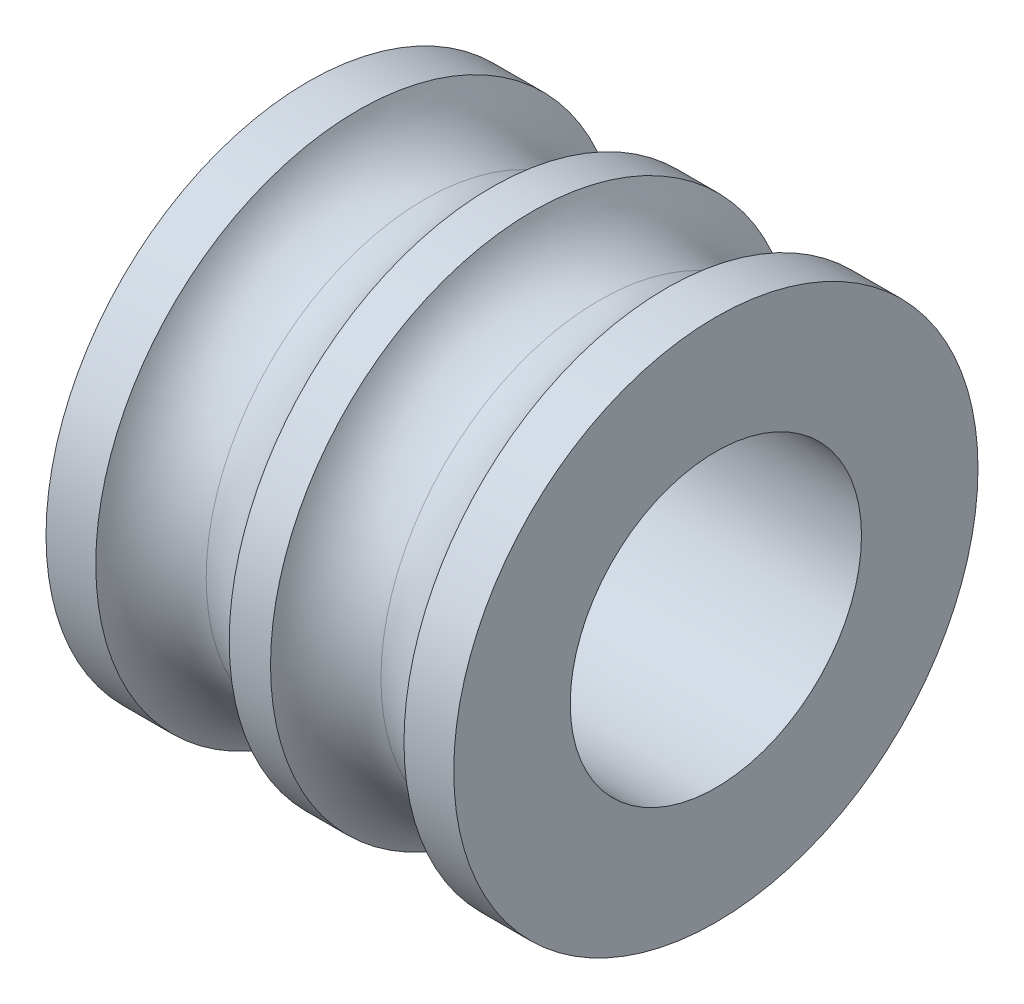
ISO-10303-21;
HEADER;
FILE_DESCRIPTION(('STEP AP214'),'2;1');
FILE_NAME('part.step','',(''),(''),'','','');
FILE_SCHEMA(('AUTOMOTIVE_DESIGN { 1 0 10303 214 1 1 1 1 }'));
ENDSEC;
DATA;
#1=APPLICATION_CONTEXT('core data for automotive mechanical design processes');
#2=APPLICATION_PROTOCOL_DEFINITION('international standard','automotive_design',2000,#1);
#3=PRODUCT_CONTEXT('',#1,'mechanical');
#4=PRODUCT('Part','Part','',(#3));
#5=PRODUCT_RELATED_PRODUCT_CATEGORY('part','',(#4));
#6=PRODUCT_DEFINITION_FORMATION('','',#4);
#7=PRODUCT_DEFINITION_CONTEXT('part definition',#1,'design');
#8=PRODUCT_DEFINITION('design','',#6,#7);
#9=PRODUCT_DEFINITION_SHAPE('','',#8);
#10=(LENGTH_UNIT() NAMED_UNIT(*) SI_UNIT(.MILLI.,.METRE.));
#11=(NAMED_UNIT(*) PLANE_ANGLE_UNIT() SI_UNIT($,.RADIAN.));
#12=(NAMED_UNIT(*) SI_UNIT($,.STERADIAN.) SOLID_ANGLE_UNIT());
#13=UNCERTAINTY_MEASURE_WITH_UNIT(LENGTH_MEASURE(1.E-05),#10,'distance_accuracy_value','');
#14=(GEOMETRIC_REPRESENTATION_CONTEXT(3) GLOBAL_UNCERTAINTY_ASSIGNED_CONTEXT((#13)) GLOBAL_UNIT_ASSIGNED_CONTEXT((#10,
#11,#12)) REPRESENTATION_CONTEXT('',''));
#15=CARTESIAN_POINT('',(0.,0.,0.));
#16=DIRECTION('',(0.,0.,1.));
#17=DIRECTION('',(1.,0.,0.));
#18=AXIS2_PLACEMENT_3D('',#15,#16,#17);
#19=CARTESIAN_POINT('',(7.70871215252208,0.,0.));
#20=DIRECTION('',(-1.,0.,0.));
#21=DIRECTION('',(0.,0.,1.));
#22=AXIS2_PLACEMENT_3D('',#19,#20,#21);
#23=CYLINDRICAL_SURFACE('',#22,9.00000000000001);
#24=CARTESIAN_POINT('',(6.29128784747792,0.,0.));
#25=DIRECTION('',(-1.,0.,0.));
#26=DIRECTION('',(0.,0.,1.));
#27=AXIS2_PLACEMENT_3D('',#24,#25,#26);
#28=CIRCLE('',#27,9.00000000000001);
#29=CARTESIAN_POINT('',(6.29128784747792,0.,9.00000000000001));
#30=VERTEX_POINT('',#29);
#31=EDGE_CURVE('E59',#30,#30,#28,.F.);
#32=ORIENTED_EDGE('',*,*,#31,.T.);
#33=EDGE_LOOP('',(#32));
#34=FACE_BOUND('',#33,.T.);
#35=CARTESIAN_POINT('',(7.70871215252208,0.,0.));
#36=DIRECTION('',(-1.,0.,0.));
#37=DIRECTION('',(0.,0.,1.));
#38=AXIS2_PLACEMENT_3D('',#35,#36,#37);
#39=CIRCLE('',#38,9.00000000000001);
#40=CARTESIAN_POINT('',(7.70871215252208,0.,9.00000000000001));
#41=VERTEX_POINT('',#40);
#42=EDGE_CURVE('E64',#41,#41,#39,.T.);
#43=ORIENTED_EDGE('',*,*,#42,.T.);
#44=EDGE_LOOP('',(#43));
#45=FACE_BOUND('',#44,.T.);
#46=ADVANCED_FACE('F14',(#34,#45),#23,.T.);
#47=CARTESIAN_POINT('',(10.,10.112712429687,7.3473156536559));
#48=CARTESIAN_POINT('',(12.5,10.112712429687,7.3473156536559));
#49=CARTESIAN_POINT('',(12.5,8.0901699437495,5.8778525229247));
#50=CARTESIAN_POINT('',(12.5,6.0676274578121,4.4083893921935));
#51=CARTESIAN_POINT('',(10.,6.0676274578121,4.4083893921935));
#52=(BOUNDED_CURVE() B_SPLINE_CURVE(2,(#47,#48,#49,#50,#51),.UNSPECIFIED.,.F.,
.F.) B_SPLINE_CURVE_WITH_KNOTS((3,2,3),(0.,0.25,0.5),
.UNSPECIFIED.) CURVE() GEOMETRIC_REPRESENTATION_ITEM() RATIONAL_B_SPLINE_CURVE((1.,
0.70710678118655,1.,0.70710678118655,1.)) REPRESENTATION_ITEM(''));
#53=CARTESIAN_POINT('',(12.5,0.,0.));
#54=DIRECTION('',(-1.,0.,0.));
#55=AXIS1_PLACEMENT('',#53,#54);
#56=SURFACE_OF_REVOLUTION('',#52,#55);
#57=CARTESIAN_POINT('',(12.2912878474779,0.,0.));
#58=DIRECTION('',(-1.,0.,0.));
#59=DIRECTION('',(0.,0.,1.));
#60=AXIS2_PLACEMENT_3D('',#57,#58,#59);
#61=CIRCLE('',#60,9.00000000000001);
#62=CARTESIAN_POINT('',(12.2912878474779,0.,9.00000000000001));
#63=VERTEX_POINT('',#62);
#64=EDGE_CURVE('E51',#63,#63,#61,.T.);
#65=ORIENTED_EDGE('',*,*,#64,.T.);
#66=EDGE_LOOP('',(#65));
#67=FACE_BOUND('',#66,.T.);
#68=CARTESIAN_POINT('',(10.,0.,0.));
#69=DIRECTION('',(-1.,0.,0.));
#70=DIRECTION('',(0.,0.80901699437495,0.587785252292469));
#71=AXIS2_PLACEMENT_3D('',#68,#69,#70);
#72=CIRCLE('',#71,7.49999999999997);
#73=CARTESIAN_POINT('',(10.,6.0676274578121,4.4083893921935));
#74=VERTEX_POINT('',#73);
#75=EDGE_CURVE('E62',#74,#74,#72,.T.);
#76=ORIENTED_EDGE('',*,*,#75,.F.);
#77=EDGE_LOOP('',(#76));
#78=FACE_BOUND('',#77,.T.);
#79=ADVANCED_FACE('F87',(#67,#78),#56,.T.);
#80=CARTESIAN_POINT('',(10.,6.0676274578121,4.4083893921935));
#81=CARTESIAN_POINT('',(7.5,6.0676274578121,4.4083893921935));
#82=CARTESIAN_POINT('',(7.5,8.0901699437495,5.8778525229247));
#83=CARTESIAN_POINT('',(7.5,10.112712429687,7.3473156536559));
#84=CARTESIAN_POINT('',(10.,10.112712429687,7.3473156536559));
#85=(BOUNDED_CURVE() B_SPLINE_CURVE(2,(#80,#81,#82,#83,#84),.UNSPECIFIED.,.F.,
.F.) B_SPLINE_CURVE_WITH_KNOTS((3,2,3),(0.5,0.75,1.),
.UNSPECIFIED.) CURVE() GEOMETRIC_REPRESENTATION_ITEM() RATIONAL_B_SPLINE_CURVE((1.,
0.70710678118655,1.,0.70710678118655,1.)) REPRESENTATION_ITEM(''));
#86=CARTESIAN_POINT('',(12.5,0.,0.));
#87=DIRECTION('',(-1.,0.,0.));
#88=AXIS1_PLACEMENT('',#86,#87);
#89=SURFACE_OF_REVOLUTION('',#85,#88);
#90=ORIENTED_EDGE('',*,*,#75,.T.);
#91=EDGE_LOOP('',(#90));
#92=FACE_BOUND('',#91,.T.);
#93=ORIENTED_EDGE('',*,*,#42,.F.);
#94=EDGE_LOOP('',(#93));
#95=FACE_BOUND('',#94,.T.);
#96=ADVANCED_FACE('F91',(#92,#95),#89,.T.);
#97=CARTESIAN_POINT('',(4.,10.112712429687,7.3473156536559));
#98=CARTESIAN_POINT('',(6.5,10.112712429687,7.3473156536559));
#99=CARTESIAN_POINT('',(6.5,8.0901699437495,5.8778525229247));
#100=CARTESIAN_POINT('',(6.5,6.0676274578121,4.4083893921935));
#101=CARTESIAN_POINT('',(4.,6.0676274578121,4.4083893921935));
#102=(BOUNDED_CURVE() B_SPLINE_CURVE(2,(#97,#98,#99,#100,#101),.UNSPECIFIED.,.F.,
.F.) B_SPLINE_CURVE_WITH_KNOTS((3,2,3),(0.,0.25,0.5),
.UNSPECIFIED.) CURVE() GEOMETRIC_REPRESENTATION_ITEM() RATIONAL_B_SPLINE_CURVE((1.,
0.70710678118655,1.,0.70710678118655,1.)) REPRESENTATION_ITEM(''));
#103=CARTESIAN_POINT('',(6.5,0.,0.));
#104=DIRECTION('',(-1.,0.,0.));
#105=AXIS1_PLACEMENT('',#103,#104);
#106=SURFACE_OF_REVOLUTION('',#102,#105);
#107=ORIENTED_EDGE('',*,*,#31,.F.);
#108=EDGE_LOOP('',(#107));
#109=FACE_BOUND('',#108,.T.);
#110=CARTESIAN_POINT('',(4.,0.,0.));
#111=DIRECTION('',(-1.,0.,0.));
#112=DIRECTION('',(0.,0.80901699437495,0.587785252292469));
#113=AXIS2_PLACEMENT_3D('',#110,#111,#112);
#114=CIRCLE('',#113,7.49999999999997);
#115=CARTESIAN_POINT('',(4.,6.0676274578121,4.4083893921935));
#116=VERTEX_POINT('',#115);
#117=EDGE_CURVE('E56',#116,#116,#114,.T.);
#118=ORIENTED_EDGE('',*,*,#117,.F.);
#119=EDGE_LOOP('',(#118));
#120=FACE_BOUND('',#119,.T.);
#121=ADVANCED_FACE('F95',(#109,#120),#106,.T.);
#122=CARTESIAN_POINT('',(4.,6.0676274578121,4.4083893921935));
#123=CARTESIAN_POINT('',(1.5,6.0676274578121,4.4083893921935));
#124=CARTESIAN_POINT('',(1.5,8.0901699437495,5.8778525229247));
#125=CARTESIAN_POINT('',(1.5,10.112712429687,7.3473156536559));
#126=CARTESIAN_POINT('',(4.,10.112712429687,7.3473156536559));
#127=(BOUNDED_CURVE() B_SPLINE_CURVE(2,(#122,#123,#124,#125,#126),.UNSPECIFIED.,.F.,
.F.) B_SPLINE_CURVE_WITH_KNOTS((3,2,3),(0.5,0.75,1.),
.UNSPECIFIED.) CURVE() GEOMETRIC_REPRESENTATION_ITEM() RATIONAL_B_SPLINE_CURVE((1.,
0.70710678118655,1.,0.70710678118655,1.)) REPRESENTATION_ITEM(''));
#128=CARTESIAN_POINT('',(6.5,0.,0.));
#129=DIRECTION('',(-1.,0.,0.));
#130=AXIS1_PLACEMENT('',#128,#129);
#131=SURFACE_OF_REVOLUTION('',#127,#130);
#132=ORIENTED_EDGE('',*,*,#117,.T.);
#133=EDGE_LOOP('',(#132));
#134=FACE_BOUND('',#133,.T.);
#135=CARTESIAN_POINT('',(1.70871215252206,0.,0.));
#136=DIRECTION('',(-1.,0.,0.));
#137=DIRECTION('',(0.,0.,1.));
#138=AXIS2_PLACEMENT_3D('',#135,#136,#137);
#139=CIRCLE('',#138,9.00000000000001);
#140=CARTESIAN_POINT('',(1.70871215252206,0.,9.00000000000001));
#141=VERTEX_POINT('',#140);
#142=EDGE_CURVE('E41',#141,#141,#139,.F.);
#143=ORIENTED_EDGE('',*,*,#142,.T.);
#144=EDGE_LOOP('',(#143));
#145=FACE_BOUND('',#144,.T.);
#146=ADVANCED_FACE('F98',(#134,#145),#131,.T.);
#147=CARTESIAN_POINT('',(14.,0.,0.));
#148=DIRECTION('',(-1.,0.,0.));
#149=DIRECTION('',(0.,0.,1.));
#150=AXIS2_PLACEMENT_3D('',#147,#148,#149);
#151=CYLINDRICAL_SURFACE('',#150,9.00000000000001);
#152=ORIENTED_EDGE('',*,*,#64,.F.);
#153=EDGE_LOOP('',(#152));
#154=FACE_BOUND('',#153,.T.);
#155=CARTESIAN_POINT('',(14.,0.,0.));
#156=DIRECTION('',(-1.,0.,0.));
#157=DIRECTION('',(0.,0.,1.));
#158=AXIS2_PLACEMENT_3D('',#155,#156,#157);
#159=CIRCLE('',#158,9.00000000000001);
#160=CARTESIAN_POINT('',(14.,0.,9.00000000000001));
#161=VERTEX_POINT('',#160);
#162=EDGE_CURVE('E46',#161,#161,#159,.F.);
#163=ORIENTED_EDGE('',*,*,#162,.F.);
#164=EDGE_LOOP('',(#163));
#165=FACE_BOUND('',#164,.T.);
#166=ADVANCED_FACE('F115',(#154,#165),#151,.T.);
#167=CARTESIAN_POINT('',(14.,-1.9910856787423,-12.571220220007));
#168=DIRECTION('',(1.,0.,0.));
#169=DIRECTION('',(0.,0.809016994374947,0.587785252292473));
#170=AXIS2_PLACEMENT_3D('',#167,#168,#169);
#171=PLANE('',#170);
#172=CARTESIAN_POINT('',(14.,0.,0.));
#173=DIRECTION('',(-1.,0.,0.));
#174=DIRECTION('',(0.,0.,1.));
#175=AXIS2_PLACEMENT_3D('',#172,#173,#174);
#176=CIRCLE('',#175,4.99999999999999);
#177=CARTESIAN_POINT('',(14.,0.,4.99999999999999));
#178=VERTEX_POINT('',#177);
#179=EDGE_CURVE('E27',#178,#178,#176,.F.);
#180=ORIENTED_EDGE('',*,*,#179,.F.);
#181=EDGE_LOOP('',(#180));
#182=FACE_BOUND('',#181,.T.);
#183=ORIENTED_EDGE('',*,*,#162,.T.);
#184=EDGE_LOOP('',(#183));
#185=FACE_BOUND('',#184,.T.);
#186=ADVANCED_FACE('F121',(#182,#185),#171,.T.);
#187=CARTESIAN_POINT('',(1.70871215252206,0.,0.));
#188=DIRECTION('',(-1.,0.,0.));
#189=DIRECTION('',(0.,0.,1.));
#190=AXIS2_PLACEMENT_3D('',#187,#188,#189);
#191=CYLINDRICAL_SURFACE('',#190,9.00000000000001);
#192=CARTESIAN_POINT('',(0.,0.,0.));
#193=DIRECTION('',(-1.,0.,0.));
#194=DIRECTION('',(0.,0.,1.));
#195=AXIS2_PLACEMENT_3D('',#192,#193,#194);
#196=CIRCLE('',#195,9.00000000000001);
#197=CARTESIAN_POINT('',(0.,0.,9.00000000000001));
#198=VERTEX_POINT('',#197);
#199=EDGE_CURVE('E22',#198,#198,#196,.T.);
#200=ORIENTED_EDGE('',*,*,#199,.F.);
#201=EDGE_LOOP('',(#200));
#202=FACE_BOUND('',#201,.T.);
#203=ORIENTED_EDGE('',*,*,#142,.F.);
#204=EDGE_LOOP('',(#203));
#205=FACE_BOUND('',#204,.T.);
#206=ADVANCED_FACE('F118',(#202,#205),#191,.T.);
#207=CARTESIAN_POINT('',(14.,0.,0.));
#208=DIRECTION('',(-1.,0.,0.));
#209=DIRECTION('',(0.,0.,1.));
#210=AXIS2_PLACEMENT_3D('',#207,#208,#209);
#211=CYLINDRICAL_SURFACE('',#210,4.99999999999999);
#212=CARTESIAN_POINT('',(0.,0.,0.));
#213=DIRECTION('',(-1.,0.,0.));
#214=DIRECTION('',(0.,0.,1.));
#215=AXIS2_PLACEMENT_3D('',#212,#213,#214);
#216=CIRCLE('',#215,4.99999999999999);
#217=CARTESIAN_POINT('',(0.,0.,4.99999999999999));
#218=VERTEX_POINT('',#217);
#219=EDGE_CURVE('E10',#218,#218,#216,.F.);
#220=ORIENTED_EDGE('',*,*,#219,.F.);
#221=EDGE_LOOP('',(#220));
#222=FACE_BOUND('',#221,.T.);
#223=ORIENTED_EDGE('',*,*,#179,.T.);
#224=EDGE_LOOP('',(#223));
#225=FACE_BOUND('',#224,.T.);
#226=ADVANCED_FACE('F120',(#222,#225),#211,.F.);
#227=CARTESIAN_POINT('',(0.,-12.571220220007,1.9910856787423));
#228=DIRECTION('',(-1.,0.,0.));
#229=DIRECTION('',(0.,0.809016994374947,0.587785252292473));
#230=AXIS2_PLACEMENT_3D('',#227,#228,#229);
#231=PLANE('',#230);
#232=ORIENTED_EDGE('',*,*,#219,.T.);
#233=EDGE_LOOP('',(#232));
#234=FACE_BOUND('',#233,.T.);
#235=ORIENTED_EDGE('',*,*,#199,.T.);
#236=EDGE_LOOP('',(#235));
#237=FACE_BOUND('',#236,.T.);
#238=ADVANCED_FACE('F16',(#234,#237),#231,.T.);
#239=CLOSED_SHELL('',(#46,#79,#96,#121,#146,#166,#186,#206,#226,#238));
#240=MANIFOLD_SOLID_BREP('B1',#239);
#241=ADVANCED_BREP_SHAPE_REPRESENTATION('',(#18,#240),#14);
#242=SHAPE_DEFINITION_REPRESENTATION(#9,#241);
ENDSEC;
END-ISO-10303-21;
